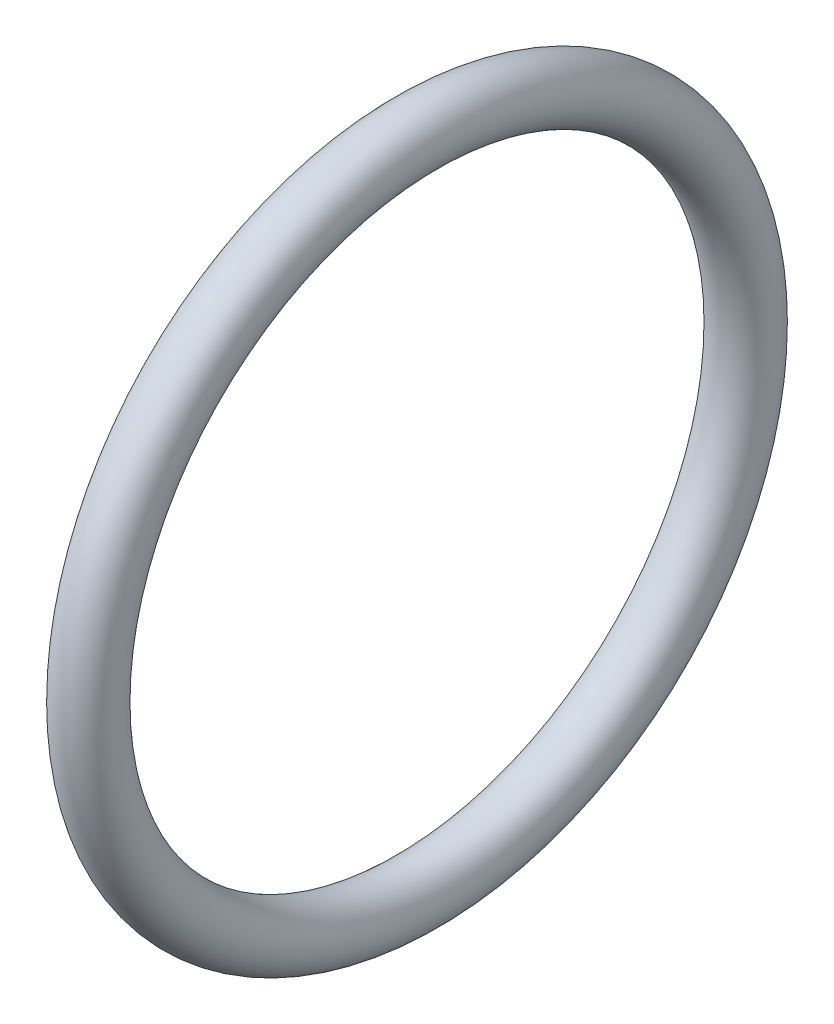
ISO-10303-21;
HEADER;
FILE_DESCRIPTION(('STEP AP214'),'2;1');
FILE_NAME('part.step','',(''),(''),'','','');
FILE_SCHEMA(('AUTOMOTIVE_DESIGN { 1 0 10303 214 1 1 1 1 }'));
ENDSEC;
DATA;
#1=APPLICATION_CONTEXT('core data for automotive mechanical design processes');
#2=APPLICATION_PROTOCOL_DEFINITION('international standard','automotive_design',2000,#1);
#3=PRODUCT_CONTEXT('',#1,'mechanical');
#4=PRODUCT('Part','Part','',(#3));
#5=PRODUCT_RELATED_PRODUCT_CATEGORY('part','',(#4));
#6=PRODUCT_DEFINITION_FORMATION('','',#4);
#7=PRODUCT_DEFINITION_CONTEXT('part definition',#1,'design');
#8=PRODUCT_DEFINITION('design','',#6,#7);
#9=PRODUCT_DEFINITION_SHAPE('','',#8);
#10=(LENGTH_UNIT() NAMED_UNIT(*) SI_UNIT(.MILLI.,.METRE.));
#11=(NAMED_UNIT(*) PLANE_ANGLE_UNIT() SI_UNIT($,.RADIAN.));
#12=(NAMED_UNIT(*) SI_UNIT($,.STERADIAN.) SOLID_ANGLE_UNIT());
#13=UNCERTAINTY_MEASURE_WITH_UNIT(LENGTH_MEASURE(1.E-05),#10,'distance_accuracy_value','');
#14=(GEOMETRIC_REPRESENTATION_CONTEXT(3) GLOBAL_UNCERTAINTY_ASSIGNED_CONTEXT((#13)) GLOBAL_UNIT_ASSIGNED_CONTEXT((#10,
#11,#12)) REPRESENTATION_CONTEXT('',''));
#15=CARTESIAN_POINT('',(0.,0.,0.));
#16=DIRECTION('',(0.,0.,1.));
#17=DIRECTION('',(1.,0.,0.));
#18=AXIS2_PLACEMENT_3D('',#15,#16,#17);
#19=CARTESIAN_POINT('',(0.,0.,0.));
#20=DIRECTION('',(-1.,0.,0.));
#21=DIRECTION('',(0.,0.,1.));
#22=AXIS2_PLACEMENT_3D('',#19,#20,#21);
#23=TOROIDAL_SURFACE('',#22,19.5,1.75);
#24=CARTESIAN_POINT('',(0.,0.,21.25));
#25=VERTEX_POINT('',#24);
#26=VERTEX_LOOP('',#25);
#27=FACE_BOUND('',#26,.T.);
#28=ADVANCED_FACE('F22',(#27),#23,.T.);
#29=CLOSED_SHELL('',(#28));
#30=MANIFOLD_SOLID_BREP('B2',#29);
#31=ADVANCED_BREP_SHAPE_REPRESENTATION('',(#18,#30),#14);
#32=SHAPE_DEFINITION_REPRESENTATION(#9,#31);
ENDSEC;
END-ISO-10303-21;
